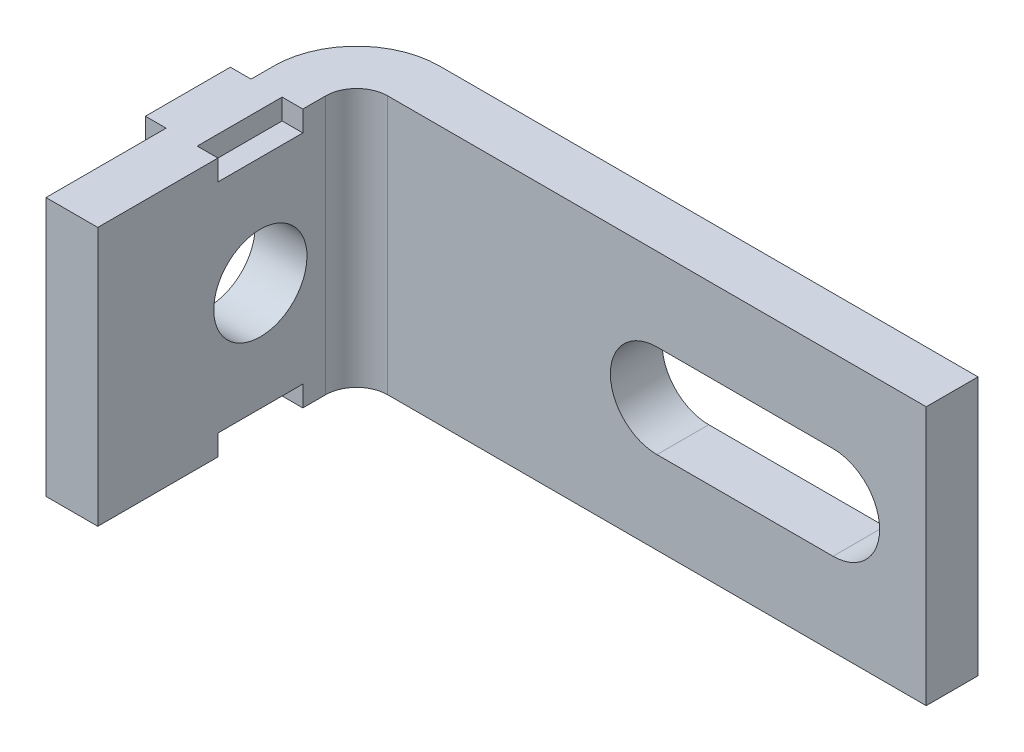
ISO-10303-21;
HEADER;
FILE_DESCRIPTION(('STEP AP214'),'2;1');
FILE_NAME('part.step','',(''),(''),'','','');
FILE_SCHEMA(('AUTOMOTIVE_DESIGN { 1 0 10303 214 1 1 1 1 }'));
ENDSEC;
DATA;
#1=APPLICATION_CONTEXT('core data for automotive mechanical design processes');
#2=APPLICATION_PROTOCOL_DEFINITION('international standard','automotive_design',2000,#1);
#3=PRODUCT_CONTEXT('',#1,'mechanical');
#4=PRODUCT('Part','Part','',(#3));
#5=PRODUCT_RELATED_PRODUCT_CATEGORY('part','',(#4));
#6=PRODUCT_DEFINITION_FORMATION('','',#4);
#7=PRODUCT_DEFINITION_CONTEXT('part definition',#1,'design');
#8=PRODUCT_DEFINITION('design','',#6,#7);
#9=PRODUCT_DEFINITION_SHAPE('','',#8);
#10=(LENGTH_UNIT() NAMED_UNIT(*) SI_UNIT(.MILLI.,.METRE.));
#11=(NAMED_UNIT(*) PLANE_ANGLE_UNIT() SI_UNIT($,.RADIAN.));
#12=(NAMED_UNIT(*) SI_UNIT($,.STERADIAN.) SOLID_ANGLE_UNIT());
#13=UNCERTAINTY_MEASURE_WITH_UNIT(LENGTH_MEASURE(1.E-05),#10,'distance_accuracy_value','');
#14=(GEOMETRIC_REPRESENTATION_CONTEXT(3) GLOBAL_UNCERTAINTY_ASSIGNED_CONTEXT((#13)) GLOBAL_UNIT_ASSIGNED_CONTEXT((#10,
#11,#12)) REPRESENTATION_CONTEXT('',''));
#15=CARTESIAN_POINT('',(0.,0.,0.));
#16=DIRECTION('',(0.,0.,1.));
#17=DIRECTION('',(1.,0.,0.));
#18=AXIS2_PLACEMENT_3D('',#15,#16,#17);
#19=CARTESIAN_POINT('',(-30.,10.5,18.4));
#20=DIRECTION('',(0.,-1.,0.));
#21=DIRECTION('',(0.,0.,-1.));
#22=AXIS2_PLACEMENT_3D('',#19,#20,#21);
#23=PLANE('',#22);
#24=DIRECTION('',(0.,0.,-1.));
#25=VECTOR('',#24,1.);
#26=CARTESIAN_POINT('',(-32.,10.5,18.4));
#27=LINE('',#26,#25);
#28=CARTESIAN_POINT('',(-32.,10.5,18.4));
#29=VERTEX_POINT('',#28);
#30=CARTESIAN_POINT('',(-32.,10.5,10.2));
#31=VERTEX_POINT('',#30);
#32=EDGE_CURVE('E9',#29,#31,#27,.T.);
#33=ORIENTED_EDGE('',*,*,#32,.T.);
#34=DIRECTION('',(-1.,0.,0.));
#35=VECTOR('',#34,1.);
#36=CARTESIAN_POINT('',(-30.,10.5,10.2));
#37=LINE('',#36,#35);
#38=CARTESIAN_POINT('',(-30.,10.5,10.2));
#39=VERTEX_POINT('',#38);
#40=EDGE_CURVE('E34',#39,#31,#37,.T.);
#41=ORIENTED_EDGE('',*,*,#40,.F.);
#42=DIRECTION('',(0.,0.,-1.));
#43=VECTOR('',#42,1.);
#44=CARTESIAN_POINT('',(-30.,10.5,24.2));
#45=LINE('',#44,#43);
#46=CARTESIAN_POINT('',(-30.,10.5,18.4));
#47=VERTEX_POINT('',#46);
#48=EDGE_CURVE('E231',#47,#39,#45,.T.);
#49=ORIENTED_EDGE('',*,*,#48,.F.);
#50=DIRECTION('',(-1.,0.,0.));
#51=VECTOR('',#50,1.);
#52=CARTESIAN_POINT('',(-30.,10.5,18.4));
#53=LINE('',#52,#51);
#54=EDGE_CURVE('E25',#47,#29,#53,.T.);
#55=ORIENTED_EDGE('',*,*,#54,.T.);
#56=EDGE_LOOP('',(#33,#41,#49,#55));
#57=FACE_BOUND('',#56,.T.);
#58=ADVANCED_FACE('F15',(#57),#23,.T.);
#59=CARTESIAN_POINT('',(-30.,10.5,10.2));
#60=DIRECTION('',(0.,0.,-1.));
#61=DIRECTION('',(-1.,0.,0.));
#62=AXIS2_PLACEMENT_3D('',#59,#60,#61);
#63=PLANE('',#62);
#64=DIRECTION('',(0.,1.,0.));
#65=VECTOR('',#64,1.);
#66=CARTESIAN_POINT('',(-32.,10.5,10.2));
#67=LINE('',#66,#65);
#68=CARTESIAN_POINT('',(-32.,12.5,10.2));
#69=VERTEX_POINT('',#68);
#70=EDGE_CURVE('E425',#31,#69,#67,.T.);
#71=ORIENTED_EDGE('',*,*,#70,.T.);
#72=DIRECTION('',(-1.,0.,0.));
#73=VECTOR('',#72,1.);
#74=CARTESIAN_POINT('',(-30.,12.5,10.2));
#75=LINE('',#74,#73);
#76=CARTESIAN_POINT('',(-30.,12.5,10.2));
#77=VERTEX_POINT('',#76);
#78=EDGE_CURVE('E243',#77,#69,#75,.T.);
#79=ORIENTED_EDGE('',*,*,#78,.F.);
#80=DIRECTION('',(0.,1.,0.));
#81=VECTOR('',#80,1.);
#82=CARTESIAN_POINT('',(-30.,5.25,10.2));
#83=LINE('',#82,#81);
#84=EDGE_CURVE('E335',#39,#77,#83,.T.);
#85=ORIENTED_EDGE('',*,*,#84,.F.);
#86=ORIENTED_EDGE('',*,*,#40,.T.);
#87=EDGE_LOOP('',(#71,#79,#85,#86));
#88=FACE_BOUND('',#87,.T.);
#89=ADVANCED_FACE('F440',(#88),#63,.T.);
#90=CARTESIAN_POINT('',(-30.,12.5,18.4));
#91=DIRECTION('',(0.,0.,1.));
#92=DIRECTION('',(1.,0.,0.));
#93=AXIS2_PLACEMENT_3D('',#90,#91,#92);
#94=PLANE('',#93);
#95=DIRECTION('',(0.,-1.,0.));
#96=VECTOR('',#95,1.);
#97=CARTESIAN_POINT('',(-32.,12.5,18.4));
#98=LINE('',#97,#96);
#99=CARTESIAN_POINT('',(-32.,12.5,18.4));
#100=VERTEX_POINT('',#99);
#101=EDGE_CURVE('E237',#100,#29,#98,.T.);
#102=ORIENTED_EDGE('',*,*,#101,.T.);
#103=ORIENTED_EDGE('',*,*,#54,.F.);
#104=DIRECTION('',(0.,-1.,0.));
#105=VECTOR('',#104,1.);
#106=CARTESIAN_POINT('',(-30.,6.25,18.4));
#107=LINE('',#106,#105);
#108=CARTESIAN_POINT('',(-30.,12.5,18.4));
#109=VERTEX_POINT('',#108);
#110=EDGE_CURVE('E230',#109,#47,#107,.T.);
#111=ORIENTED_EDGE('',*,*,#110,.F.);
#112=DIRECTION('',(-1.,0.,0.));
#113=VECTOR('',#112,1.);
#114=CARTESIAN_POINT('',(-30.,12.5,18.4));
#115=LINE('',#114,#113);
#116=EDGE_CURVE('E229',#109,#100,#115,.T.);
#117=ORIENTED_EDGE('',*,*,#116,.T.);
#118=EDGE_LOOP('',(#102,#103,#111,#117));
#119=FACE_BOUND('',#118,.T.);
#120=ADVANCED_FACE('F433',(#119),#94,.T.);
#121=CARTESIAN_POINT('',(-32.,11.5,14.3));
#122=DIRECTION('',(1.,0.,0.));
#123=DIRECTION('',(0.,0.,-1.));
#124=AXIS2_PLACEMENT_3D('',#121,#122,#123);
#125=PLANE('',#124);
#126=ORIENTED_EDGE('',*,*,#32,.F.);
#127=ORIENTED_EDGE('',*,*,#101,.F.);
#128=DIRECTION('',(0.,0.,1.));
#129=VECTOR('',#128,1.);
#130=CARTESIAN_POINT('',(-32.,12.5,10.2));
#131=LINE('',#130,#129);
#132=EDGE_CURVE('E241',#69,#100,#131,.T.);
#133=ORIENTED_EDGE('',*,*,#132,.F.);
#134=ORIENTED_EDGE('',*,*,#70,.F.);
#135=EDGE_LOOP('',(#126,#127,#133,#134));
#136=FACE_BOUND('',#135,.T.);
#137=ADVANCED_FACE('F437',(#136),#125,.F.);
#138=CARTESIAN_POINT('',(-30.,-12.5,10.2));
#139=DIRECTION('',(0.,0.,-1.));
#140=DIRECTION('',(-1.,0.,0.));
#141=AXIS2_PLACEMENT_3D('',#138,#139,#140);
#142=PLANE('',#141);
#143=DIRECTION('',(0.,1.,0.));
#144=VECTOR('',#143,1.);
#145=CARTESIAN_POINT('',(-32.,-12.5,10.2));
#146=LINE('',#145,#144);
#147=CARTESIAN_POINT('',(-32.,-12.5,10.2));
#148=VERTEX_POINT('',#147);
#149=CARTESIAN_POINT('',(-32.,-10.5,10.2));
#150=VERTEX_POINT('',#149);
#151=EDGE_CURVE('E240',#148,#150,#146,.T.);
#152=ORIENTED_EDGE('',*,*,#151,.T.);
#153=DIRECTION('',(-1.,0.,0.));
#154=VECTOR('',#153,1.);
#155=CARTESIAN_POINT('',(-30.,-10.5,10.2));
#156=LINE('',#155,#154);
#157=CARTESIAN_POINT('',(-30.,-10.5,10.2));
#158=VERTEX_POINT('',#157);
#159=EDGE_CURVE('E248',#158,#150,#156,.T.);
#160=ORIENTED_EDGE('',*,*,#159,.F.);
#161=DIRECTION('',(0.,1.,0.));
#162=VECTOR('',#161,1.);
#163=CARTESIAN_POINT('',(-30.,-6.25,10.2));
#164=LINE('',#163,#162);
#165=CARTESIAN_POINT('',(-30.,-12.5,10.2));
#166=VERTEX_POINT('',#165);
#167=EDGE_CURVE('E252',#166,#158,#164,.T.);
#168=ORIENTED_EDGE('',*,*,#167,.F.);
#169=DIRECTION('',(-1.,0.,0.));
#170=VECTOR('',#169,1.);
#171=CARTESIAN_POINT('',(-30.,-12.5,10.2));
#172=LINE('',#171,#170);
#173=EDGE_CURVE('E247',#166,#148,#172,.T.);
#174=ORIENTED_EDGE('',*,*,#173,.T.);
#175=EDGE_LOOP('',(#152,#160,#168,#174));
#176=FACE_BOUND('',#175,.T.);
#177=ADVANCED_FACE('F454',(#176),#142,.T.);
#178=CARTESIAN_POINT('',(-30.,-10.5,10.2));
#179=DIRECTION('',(0.,1.,0.));
#180=DIRECTION('',(0.,0.,1.));
#181=AXIS2_PLACEMENT_3D('',#178,#179,#180);
#182=PLANE('',#181);
#183=DIRECTION('',(0.,0.,1.));
#184=VECTOR('',#183,1.);
#185=CARTESIAN_POINT('',(-32.,-10.5,10.2));
#186=LINE('',#185,#184);
#187=CARTESIAN_POINT('',(-32.,-10.5,18.4));
#188=VERTEX_POINT('',#187);
#189=EDGE_CURVE('E250',#150,#188,#186,.T.);
#190=ORIENTED_EDGE('',*,*,#189,.T.);
#191=DIRECTION('',(-1.,0.,0.));
#192=VECTOR('',#191,1.);
#193=CARTESIAN_POINT('',(-30.,-10.5,18.4));
#194=LINE('',#193,#192);
#195=CARTESIAN_POINT('',(-30.,-10.5,18.4));
#196=VERTEX_POINT('',#195);
#197=EDGE_CURVE('E259',#196,#188,#194,.T.);
#198=ORIENTED_EDGE('',*,*,#197,.F.);
#199=DIRECTION('',(0.,0.,1.));
#200=VECTOR('',#199,1.);
#201=CARTESIAN_POINT('',(-30.,-10.5,20.1));
#202=LINE('',#201,#200);
#203=EDGE_CURVE('E255',#158,#196,#202,.T.);
#204=ORIENTED_EDGE('',*,*,#203,.F.);
#205=ORIENTED_EDGE('',*,*,#159,.T.);
#206=EDGE_LOOP('',(#190,#198,#204,#205));
#207=FACE_BOUND('',#206,.T.);
#208=ADVANCED_FACE('F457',(#207),#182,.T.);
#209=CARTESIAN_POINT('',(-30.,-10.5,18.4));
#210=DIRECTION('',(0.,0.,1.));
#211=DIRECTION('',(1.,0.,0.));
#212=AXIS2_PLACEMENT_3D('',#209,#210,#211);
#213=PLANE('',#212);
#214=DIRECTION('',(0.,-1.,0.));
#215=VECTOR('',#214,1.);
#216=CARTESIAN_POINT('',(-32.,-10.5,18.4));
#217=LINE('',#216,#215);
#218=CARTESIAN_POINT('',(-32.,-12.5,18.4));
#219=VERTEX_POINT('',#218);
#220=EDGE_CURVE('E251',#188,#219,#217,.T.);
#221=ORIENTED_EDGE('',*,*,#220,.T.);
#222=DIRECTION('',(-1.,0.,0.));
#223=VECTOR('',#222,1.);
#224=CARTESIAN_POINT('',(-30.,-12.5,18.4));
#225=LINE('',#224,#223);
#226=CARTESIAN_POINT('',(-30.,-12.5,18.4));
#227=VERTEX_POINT('',#226);
#228=EDGE_CURVE('E266',#227,#219,#225,.T.);
#229=ORIENTED_EDGE('',*,*,#228,.F.);
#230=DIRECTION('',(0.,-1.,0.));
#231=VECTOR('',#230,1.);
#232=CARTESIAN_POINT('',(-30.,-5.25,18.4));
#233=LINE('',#232,#231);
#234=EDGE_CURVE('E263',#196,#227,#233,.T.);
#235=ORIENTED_EDGE('',*,*,#234,.F.);
#236=ORIENTED_EDGE('',*,*,#197,.T.);
#237=EDGE_LOOP('',(#221,#229,#235,#236));
#238=FACE_BOUND('',#237,.T.);
#239=ADVANCED_FACE('F461',(#238),#213,.T.);
#240=CARTESIAN_POINT('',(-32.,-11.5,14.3));
#241=DIRECTION('',(1.,0.,0.));
#242=DIRECTION('',(0.,0.,-1.));
#243=AXIS2_PLACEMENT_3D('',#240,#241,#242);
#244=PLANE('',#243);
#245=DIRECTION('',(0.,0.,-1.));
#246=VECTOR('',#245,1.);
#247=CARTESIAN_POINT('',(-32.,-12.5,18.4));
#248=LINE('',#247,#246);
#249=EDGE_CURVE('E269',#219,#148,#248,.T.);
#250=ORIENTED_EDGE('',*,*,#249,.F.);
#251=ORIENTED_EDGE('',*,*,#220,.F.);
#252=ORIENTED_EDGE('',*,*,#189,.F.);
#253=ORIENTED_EDGE('',*,*,#151,.F.);
#254=EDGE_LOOP('',(#250,#251,#252,#253));
#255=FACE_BOUND('',#254,.T.);
#256=ADVANCED_FACE('F465',(#255),#244,.F.);
#257=CARTESIAN_POINT('',(-25.,12.5,18.4));
#258=DIRECTION('',(0.,0.,1.));
#259=DIRECTION('',(1.,0.,0.));
#260=AXIS2_PLACEMENT_3D('',#257,#258,#259);
#261=PLANE('',#260);
#262=DIRECTION('',(0.,-1.,0.));
#263=VECTOR('',#262,1.);
#264=CARTESIAN_POINT('',(-27.,10.5,18.4));
#265=LINE('',#264,#263);
#266=CARTESIAN_POINT('',(-27.,12.5,18.4));
#267=VERTEX_POINT('',#266);
#268=CARTESIAN_POINT('',(-27.,10.5,18.4));
#269=VERTEX_POINT('',#268);
#270=EDGE_CURVE('E274',#267,#269,#265,.T.);
#271=ORIENTED_EDGE('',*,*,#270,.F.);
#272=DIRECTION('',(-1.,0.,0.));
#273=VECTOR('',#272,1.);
#274=CARTESIAN_POINT('',(-16.0174599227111,12.5,18.4));
#275=LINE('',#274,#273);
#276=CARTESIAN_POINT('',(-25.,12.5,18.4));
#277=VERTEX_POINT('',#276);
#278=EDGE_CURVE('E244',#277,#267,#275,.T.);
#279=ORIENTED_EDGE('',*,*,#278,.F.);
#280=DIRECTION('',(0.,1.,0.));
#281=VECTOR('',#280,1.);
#282=CARTESIAN_POINT('',(-25.,6.25,18.4));
#283=LINE('',#282,#281);
#284=CARTESIAN_POINT('',(-25.,10.5,18.4));
#285=VERTEX_POINT('',#284);
#286=EDGE_CURVE('E280',#285,#277,#283,.T.);
#287=ORIENTED_EDGE('',*,*,#286,.F.);
#288=DIRECTION('',(-1.,0.,0.));
#289=VECTOR('',#288,1.);
#290=CARTESIAN_POINT('',(-25.,10.5,18.4));
#291=LINE('',#290,#289);
#292=EDGE_CURVE('E261',#285,#269,#291,.T.);
#293=ORIENTED_EDGE('',*,*,#292,.T.);
#294=EDGE_LOOP('',(#271,#279,#287,#293));
#295=FACE_BOUND('',#294,.T.);
#296=ADVANCED_FACE('F469',(#295),#261,.F.);
#297=CARTESIAN_POINT('',(-25.,10.5,18.4));
#298=DIRECTION('',(0.,-1.,0.));
#299=DIRECTION('',(0.,0.,-1.));
#300=AXIS2_PLACEMENT_3D('',#297,#298,#299);
#301=PLANE('',#300);
#302=DIRECTION('',(0.,0.,-1.));
#303=VECTOR('',#302,1.);
#304=CARTESIAN_POINT('',(-27.,10.5,10.2));
#305=LINE('',#304,#303);
#306=CARTESIAN_POINT('',(-27.,10.5,10.2));
#307=VERTEX_POINT('',#306);
#308=EDGE_CURVE('E277',#269,#307,#305,.T.);
#309=ORIENTED_EDGE('',*,*,#308,.F.);
#310=ORIENTED_EDGE('',*,*,#292,.F.);
#311=DIRECTION('',(0.,0.,1.));
#312=VECTOR('',#311,1.);
#313=CARTESIAN_POINT('',(-25.,10.5,13.2));
#314=LINE('',#313,#312);
#315=CARTESIAN_POINT('',(-25.,10.5,10.2));
#316=VERTEX_POINT('',#315);
#317=EDGE_CURVE('E283',#316,#285,#314,.T.);
#318=ORIENTED_EDGE('',*,*,#317,.F.);
#319=DIRECTION('',(-1.,0.,0.));
#320=VECTOR('',#319,1.);
#321=CARTESIAN_POINT('',(-25.,10.5,10.2));
#322=LINE('',#321,#320);
#323=EDGE_CURVE('E276',#316,#307,#322,.T.);
#324=ORIENTED_EDGE('',*,*,#323,.T.);
#325=EDGE_LOOP('',(#309,#310,#318,#324));
#326=FACE_BOUND('',#325,.T.);
#327=ADVANCED_FACE('F473',(#326),#301,.F.);
#328=CARTESIAN_POINT('',(-25.,10.5,10.2));
#329=DIRECTION('',(0.,0.,-1.));
#330=DIRECTION('',(-1.,0.,0.));
#331=AXIS2_PLACEMENT_3D('',#328,#329,#330);
#332=PLANE('',#331);
#333=DIRECTION('',(0.,1.,0.));
#334=VECTOR('',#333,1.);
#335=CARTESIAN_POINT('',(-27.,12.5,10.2));
#336=LINE('',#335,#334);
#337=CARTESIAN_POINT('',(-27.,12.5,10.2));
#338=VERTEX_POINT('',#337);
#339=EDGE_CURVE('E288',#307,#338,#336,.T.);
#340=ORIENTED_EDGE('',*,*,#339,.F.);
#341=ORIENTED_EDGE('',*,*,#323,.F.);
#342=DIRECTION('',(0.,-1.,0.));
#343=VECTOR('',#342,1.);
#344=CARTESIAN_POINT('',(-25.,5.25,10.2));
#345=LINE('',#344,#343);
#346=CARTESIAN_POINT('',(-25.,12.5,10.2));
#347=VERTEX_POINT('',#346);
#348=EDGE_CURVE('E291',#347,#316,#345,.T.);
#349=ORIENTED_EDGE('',*,*,#348,.F.);
#350=DIRECTION('',(1.,0.,0.));
#351=VECTOR('',#350,1.);
#352=CARTESIAN_POINT('',(-16.0174599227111,12.5,10.2));
#353=LINE('',#352,#351);
#354=EDGE_CURVE('E299',#338,#347,#353,.T.);
#355=ORIENTED_EDGE('',*,*,#354,.F.);
#356=EDGE_LOOP('',(#340,#341,#349,#355));
#357=FACE_BOUND('',#356,.T.);
#358=ADVANCED_FACE('F477',(#357),#332,.F.);
#359=CARTESIAN_POINT('',(-27.,11.5,14.3));
#360=DIRECTION('',(1.,0.,0.));
#361=DIRECTION('',(0.,0.,-1.));
#362=AXIS2_PLACEMENT_3D('',#359,#360,#361);
#363=PLANE('',#362);
#364=ORIENTED_EDGE('',*,*,#270,.T.);
#365=ORIENTED_EDGE('',*,*,#308,.T.);
#366=ORIENTED_EDGE('',*,*,#339,.T.);
#367=DIRECTION('',(0.,0.,-1.));
#368=VECTOR('',#367,1.);
#369=CARTESIAN_POINT('',(-27.,12.5,10.9305229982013));
#370=LINE('',#369,#368);
#371=EDGE_CURVE('E279',#267,#338,#370,.T.);
#372=ORIENTED_EDGE('',*,*,#371,.F.);
#373=EDGE_LOOP('',(#364,#365,#366,#372));
#374=FACE_BOUND('',#373,.T.);
#375=ADVANCED_FACE('F481',(#374),#363,.T.);
#376=CARTESIAN_POINT('',(-25.,-10.5,18.4));
#377=DIRECTION('',(0.,0.,1.));
#378=DIRECTION('',(1.,0.,0.));
#379=AXIS2_PLACEMENT_3D('',#376,#377,#378);
#380=PLANE('',#379);
#381=DIRECTION('',(0.,-1.,0.));
#382=VECTOR('',#381,1.);
#383=CARTESIAN_POINT('',(-27.,-12.5,18.4));
#384=LINE('',#383,#382);
#385=CARTESIAN_POINT('',(-27.,-10.5,18.4));
#386=VERTEX_POINT('',#385);
#387=CARTESIAN_POINT('',(-27.,-12.5,18.4));
#388=VERTEX_POINT('',#387);
#389=EDGE_CURVE('E303',#386,#388,#384,.T.);
#390=ORIENTED_EDGE('',*,*,#389,.F.);
#391=DIRECTION('',(-1.,0.,0.));
#392=VECTOR('',#391,1.);
#393=CARTESIAN_POINT('',(-25.,-10.5,18.4));
#394=LINE('',#393,#392);
#395=CARTESIAN_POINT('',(-25.,-10.5,18.4));
#396=VERTEX_POINT('',#395);
#397=EDGE_CURVE('E306',#396,#386,#394,.T.);
#398=ORIENTED_EDGE('',*,*,#397,.F.);
#399=DIRECTION('',(0.,1.,0.));
#400=VECTOR('',#399,1.);
#401=CARTESIAN_POINT('',(-25.,-5.25,18.4));
#402=LINE('',#401,#400);
#403=CARTESIAN_POINT('',(-25.,-12.5,18.4));
#404=VERTEX_POINT('',#403);
#405=EDGE_CURVE('E310',#404,#396,#402,.T.);
#406=ORIENTED_EDGE('',*,*,#405,.F.);
#407=DIRECTION('',(1.,0.,0.));
#408=VECTOR('',#407,1.);
#409=CARTESIAN_POINT('',(-16.0174599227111,-12.5,18.4));
#410=LINE('',#409,#408);
#411=EDGE_CURVE('E268',#388,#404,#410,.T.);
#412=ORIENTED_EDGE('',*,*,#411,.F.);
#413=EDGE_LOOP('',(#390,#398,#406,#412));
#414=FACE_BOUND('',#413,.T.);
#415=ADVANCED_FACE('F485',(#414),#380,.F.);
#416=CARTESIAN_POINT('',(-25.,-12.5,10.2));
#417=DIRECTION('',(0.,0.,-1.));
#418=DIRECTION('',(-1.,0.,0.));
#419=AXIS2_PLACEMENT_3D('',#416,#417,#418);
#420=PLANE('',#419);
#421=DIRECTION('',(0.,1.,0.));
#422=VECTOR('',#421,1.);
#423=CARTESIAN_POINT('',(-27.,-10.5,10.2));
#424=LINE('',#423,#422);
#425=CARTESIAN_POINT('',(-27.,-12.5,10.2));
#426=VERTEX_POINT('',#425);
#427=CARTESIAN_POINT('',(-27.,-10.5,10.2));
#428=VERTEX_POINT('',#427);
#429=EDGE_CURVE('E307',#426,#428,#424,.T.);
#430=ORIENTED_EDGE('',*,*,#429,.F.);
#431=DIRECTION('',(-1.,0.,0.));
#432=VECTOR('',#431,1.);
#433=CARTESIAN_POINT('',(-16.0174599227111,-12.5,10.2));
#434=LINE('',#433,#432);
#435=CARTESIAN_POINT('',(-25.,-12.5,10.2));
#436=VERTEX_POINT('',#435);
#437=EDGE_CURVE('E319',#436,#426,#434,.T.);
#438=ORIENTED_EDGE('',*,*,#437,.F.);
#439=DIRECTION('',(0.,-1.,0.));
#440=VECTOR('',#439,1.);
#441=CARTESIAN_POINT('',(-25.,-6.25,10.2));
#442=LINE('',#441,#440);
#443=CARTESIAN_POINT('',(-25.,-10.5,10.2));
#444=VERTEX_POINT('',#443);
#445=EDGE_CURVE('E321',#444,#436,#442,.T.);
#446=ORIENTED_EDGE('',*,*,#445,.F.);
#447=DIRECTION('',(-1.,0.,0.));
#448=VECTOR('',#447,1.);
#449=CARTESIAN_POINT('',(-25.,-10.5,10.2));
#450=LINE('',#449,#448);
#451=EDGE_CURVE('E296',#444,#428,#450,.T.);
#452=ORIENTED_EDGE('',*,*,#451,.T.);
#453=EDGE_LOOP('',(#430,#438,#446,#452));
#454=FACE_BOUND('',#453,.T.);
#455=ADVANCED_FACE('F489',(#454),#420,.F.);
#456=CARTESIAN_POINT('',(-25.,-10.5,10.2));
#457=DIRECTION('',(0.,1.,0.));
#458=DIRECTION('',(0.,0.,1.));
#459=AXIS2_PLACEMENT_3D('',#456,#457,#458);
#460=PLANE('',#459);
#461=DIRECTION('',(0.,0.,1.));
#462=VECTOR('',#461,1.);
#463=CARTESIAN_POINT('',(-27.,-10.5,18.4));
#464=LINE('',#463,#462);
#465=EDGE_CURVE('E318',#428,#386,#464,.T.);
#466=ORIENTED_EDGE('',*,*,#465,.F.);
#467=ORIENTED_EDGE('',*,*,#451,.F.);
#468=DIRECTION('',(0.,0.,-1.));
#469=VECTOR('',#468,1.);
#470=CARTESIAN_POINT('',(-25.,-10.5,9.10000000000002));
#471=LINE('',#470,#469);
#472=EDGE_CURVE('E313',#396,#444,#471,.T.);
#473=ORIENTED_EDGE('',*,*,#472,.F.);
#474=ORIENTED_EDGE('',*,*,#397,.T.);
#475=EDGE_LOOP('',(#466,#467,#473,#474));
#476=FACE_BOUND('',#475,.T.);
#477=ADVANCED_FACE('F493',(#476),#460,.F.);
#478=CARTESIAN_POINT('',(-27.,-11.5,14.3));
#479=DIRECTION('',(1.,0.,0.));
#480=DIRECTION('',(0.,0.,-1.));
#481=AXIS2_PLACEMENT_3D('',#478,#479,#480);
#482=PLANE('',#481);
#483=ORIENTED_EDGE('',*,*,#389,.T.);
#484=DIRECTION('',(0.,0.,1.));
#485=VECTOR('',#484,1.);
#486=CARTESIAN_POINT('',(-27.,-12.5,10.9305229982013));
#487=LINE('',#486,#485);
#488=EDGE_CURVE('E316',#426,#388,#487,.T.);
#489=ORIENTED_EDGE('',*,*,#488,.F.);
#490=ORIENTED_EDGE('',*,*,#429,.T.);
#491=ORIENTED_EDGE('',*,*,#465,.T.);
#492=EDGE_LOOP('',(#483,#489,#490,#491));
#493=FACE_BOUND('',#492,.T.);
#494=ADVANCED_FACE('F497',(#493),#482,.T.);
#495=CARTESIAN_POINT('',(-7.03491984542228,-12.5,7.5610459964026));
#496=DIRECTION('',(0.,1.,0.));
#497=DIRECTION('',(0.,0.,1.));
#498=AXIS2_PLACEMENT_3D('',#495,#496,#497);
#499=PLANE('',#498);
#500=ORIENTED_EDGE('',*,*,#437,.T.);
#501=ORIENTED_EDGE('',*,*,#488,.T.);
#502=ORIENTED_EDGE('',*,*,#411,.T.);
#503=DIRECTION('',(0.,0.,-1.));
#504=VECTOR('',#503,1.);
#505=CARTESIAN_POINT('',(-25.,-12.5,8.00000000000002));
#506=LINE('',#505,#504);
#507=CARTESIAN_POINT('',(-25.,-12.5,30.));
#508=VERTEX_POINT('',#507);
#509=EDGE_CURVE('E312',#508,#404,#506,.T.);
#510=ORIENTED_EDGE('',*,*,#509,.F.);
#511=DIRECTION('',(1.,0.,0.));
#512=VECTOR('',#511,1.);
#513=CARTESIAN_POINT('',(-25.,-12.5,30.));
#514=LINE('',#513,#512);
#515=CARTESIAN_POINT('',(-30.,-12.5,30.));
#516=VERTEX_POINT('',#515);
#517=EDGE_CURVE('E224',#516,#508,#514,.T.);
#518=ORIENTED_EDGE('',*,*,#517,.F.);
#519=DIRECTION('',(0.,0.,1.));
#520=VECTOR('',#519,1.);
#521=CARTESIAN_POINT('',(-30.,-12.5,30.));
#522=LINE('',#521,#520);
#523=EDGE_CURVE('E211',#227,#516,#522,.T.);
#524=ORIENTED_EDGE('',*,*,#523,.F.);
#525=ORIENTED_EDGE('',*,*,#228,.T.);
#526=ORIENTED_EDGE('',*,*,#249,.T.);
#527=ORIENTED_EDGE('',*,*,#173,.F.);
#528=DIRECTION('',(0.,0.,1.));
#529=VECTOR('',#528,1.);
#530=CARTESIAN_POINT('',(-30.,-12.5,30.));
#531=LINE('',#530,#529);
#532=CARTESIAN_POINT('',(-30.,-12.5,8.00000000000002));
#533=VERTEX_POINT('',#532);
#534=EDGE_CURVE('E254',#533,#166,#531,.T.);
#535=ORIENTED_EDGE('',*,*,#534,.F.);
#536=CARTESIAN_POINT('',(-22.,-12.5,8.00000000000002));
#537=DIRECTION('',(0.,1.,0.));
#538=DIRECTION('',(1.,0.,0.));
#539=AXIS2_PLACEMENT_3D('',#536,#537,#538);
#540=CIRCLE('',#539,8.);
#541=CARTESIAN_POINT('',(-22.,-12.5,0.));
#542=VERTEX_POINT('',#541);
#543=EDGE_CURVE('E340',#542,#533,#540,.T.);
#544=ORIENTED_EDGE('',*,*,#543,.F.);
#545=DIRECTION('',(-1.,0.,0.));
#546=VECTOR('',#545,1.);
#547=CARTESIAN_POINT('',(-22.,-12.5,0.));
#548=LINE('',#547,#546);
#549=CARTESIAN_POINT('',(30.,-12.5,0.));
#550=VERTEX_POINT('',#549);
#551=EDGE_CURVE('E345',#550,#542,#548,.T.);
#552=ORIENTED_EDGE('',*,*,#551,.F.);
#553=DIRECTION('',(0.,0.,-1.));
#554=VECTOR('',#553,1.);
#555=CARTESIAN_POINT('',(30.,-12.5,0.));
#556=LINE('',#555,#554);
#557=CARTESIAN_POINT('',(30.,-12.5,4.99999999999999));
#558=VERTEX_POINT('',#557);
#559=EDGE_CURVE('E349',#558,#550,#556,.T.);
#560=ORIENTED_EDGE('',*,*,#559,.F.);
#561=DIRECTION('',(1.,0.,0.));
#562=VECTOR('',#561,1.);
#563=CARTESIAN_POINT('',(30.,-12.5,4.99999999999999));
#564=LINE('',#563,#562);
#565=CARTESIAN_POINT('',(-22.,-12.5,5.00000000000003));
#566=VERTEX_POINT('',#565);
#567=EDGE_CURVE('E353',#566,#558,#564,.T.);
#568=ORIENTED_EDGE('',*,*,#567,.F.);
#569=CARTESIAN_POINT('',(-22.,-12.5,8.00000000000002));
#570=DIRECTION('',(0.,-1.,0.));
#571=DIRECTION('',(0.,0.,-1.));
#572=AXIS2_PLACEMENT_3D('',#569,#570,#571);
#573=CIRCLE('',#572,3.);
#574=CARTESIAN_POINT('',(-25.,-12.5,8.00000000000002));
#575=VERTEX_POINT('',#574);
#576=EDGE_CURVE('E223',#575,#566,#573,.T.);
#577=ORIENTED_EDGE('',*,*,#576,.F.);
#578=DIRECTION('',(0.,0.,-1.));
#579=VECTOR('',#578,1.);
#580=CARTESIAN_POINT('',(-25.,-12.5,8.00000000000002));
#581=LINE('',#580,#579);
#582=EDGE_CURVE('E323',#436,#575,#581,.T.);
#583=ORIENTED_EDGE('',*,*,#582,.F.);
#584=EDGE_LOOP('',(#500,#501,#502,#510,#518,#524,#525,#526,#527,#535,#544,#552,#560,#568,#577,#583));
#585=FACE_BOUND('',#584,.T.);
#586=ADVANCED_FACE('F501',(#585),#499,.F.);
#587=CARTESIAN_POINT('',(-25.,0.,8.00000000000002));
#588=DIRECTION('',(1.,0.,0.));
#589=DIRECTION('',(0.,0.,-1.));
#590=AXIS2_PLACEMENT_3D('',#587,#588,#589);
#591=PLANE('',#590);
#592=CARTESIAN_POINT('',(-25.,0.,14.3));
#593=DIRECTION('',(-1.,0.,0.));
#594=DIRECTION('',(0.,1.,0.));
#595=AXIS2_PLACEMENT_3D('',#592,#593,#594);
#596=CIRCLE('',#595,4.5);
#597=CARTESIAN_POINT('',(-25.,4.5,14.3));
#598=VERTEX_POINT('',#597);
#599=EDGE_CURVE('E273',#598,#598,#596,.T.);
#600=ORIENTED_EDGE('',*,*,#599,.T.);
#601=EDGE_LOOP('',(#600));
#602=FACE_BOUND('',#601,.T.);
#603=ORIENTED_EDGE('',*,*,#348,.T.);
#604=ORIENTED_EDGE('',*,*,#317,.T.);
#605=ORIENTED_EDGE('',*,*,#286,.T.);
#606=DIRECTION('',(0.,0.,1.));
#607=VECTOR('',#606,1.);
#608=CARTESIAN_POINT('',(-25.,12.5,8.00000000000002));
#609=LINE('',#608,#607);
#610=CARTESIAN_POINT('',(-25.,12.5,30.));
#611=VERTEX_POINT('',#610);
#612=EDGE_CURVE('E284',#277,#611,#609,.T.);
#613=ORIENTED_EDGE('',*,*,#612,.T.);
#614=DIRECTION('',(0.,-1.,0.));
#615=VECTOR('',#614,1.);
#616=CARTESIAN_POINT('',(-25.,0.,30.));
#617=LINE('',#616,#615);
#618=EDGE_CURVE('E219',#611,#508,#617,.T.);
#619=ORIENTED_EDGE('',*,*,#618,.T.);
#620=ORIENTED_EDGE('',*,*,#509,.T.);
#621=ORIENTED_EDGE('',*,*,#405,.T.);
#622=ORIENTED_EDGE('',*,*,#472,.T.);
#623=ORIENTED_EDGE('',*,*,#445,.T.);
#624=ORIENTED_EDGE('',*,*,#582,.T.);
#625=DIRECTION('',(0.,-1.,0.));
#626=VECTOR('',#625,1.);
#627=CARTESIAN_POINT('',(-25.,0.,8.00000000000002));
#628=LINE('',#627,#626);
#629=CARTESIAN_POINT('',(-25.,12.5,8.00000000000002));
#630=VERTEX_POINT('',#629);
#631=EDGE_CURVE('E357',#630,#575,#628,.T.);
#632=ORIENTED_EDGE('',*,*,#631,.F.);
#633=DIRECTION('',(0.,0.,1.));
#634=VECTOR('',#633,1.);
#635=CARTESIAN_POINT('',(-25.,12.5,8.00000000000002));
#636=LINE('',#635,#634);
#637=EDGE_CURVE('E360',#630,#347,#636,.T.);
#638=ORIENTED_EDGE('',*,*,#637,.T.);
#639=EDGE_LOOP('',(#603,#604,#605,#613,#619,#620,#621,#622,#623,#624,#632,#638));
#640=FACE_BOUND('',#639,.T.);
#641=ADVANCED_FACE('F505',(#602,#640),#591,.T.);
#642=CARTESIAN_POINT('',(21.,4.5,5.));
#643=DIRECTION('',(0.,1.,0.));
#644=DIRECTION('',(0.,0.,1.));
#645=AXIS2_PLACEMENT_3D('',#642,#643,#644);
#646=PLANE('',#645);
#647=DIRECTION('',(-1.,0.,0.));
#648=VECTOR('',#647,1.);
#649=CARTESIAN_POINT('',(-0.500000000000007,4.5,0.));
#650=LINE('',#649,#648);
#651=CARTESIAN_POINT('',(21.,4.5,0.));
#652=VERTEX_POINT('',#651);
#653=CARTESIAN_POINT('',(3.99999999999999,4.5,0.));
#654=VERTEX_POINT('',#653);
#655=EDGE_CURVE('E370',#652,#654,#650,.T.);
#656=ORIENTED_EDGE('',*,*,#655,.F.);
#657=DIRECTION('',(0.,0.,-1.));
#658=VECTOR('',#657,1.);
#659=CARTESIAN_POINT('',(21.,4.5,5.));
#660=LINE('',#659,#658);
#661=CARTESIAN_POINT('',(21.,4.5,5.));
#662=VERTEX_POINT('',#661);
#663=EDGE_CURVE('E374',#662,#652,#660,.T.);
#664=ORIENTED_EDGE('',*,*,#663,.F.);
#665=DIRECTION('',(1.,0.,0.));
#666=VECTOR('',#665,1.);
#667=CARTESIAN_POINT('',(25.5,4.5,4.99999999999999));
#668=LINE('',#667,#666);
#669=CARTESIAN_POINT('',(3.99999999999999,4.5,5.00000000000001));
#670=VERTEX_POINT('',#669);
#671=EDGE_CURVE('E379',#670,#662,#668,.T.);
#672=ORIENTED_EDGE('',*,*,#671,.F.);
#673=DIRECTION('',(0.,0.,-1.));
#674=VECTOR('',#673,1.);
#675=CARTESIAN_POINT('',(3.99999999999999,4.5,5.00000000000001));
#676=LINE('',#675,#674);
#677=EDGE_CURVE('E369',#670,#654,#676,.T.);
#678=ORIENTED_EDGE('',*,*,#677,.T.);
#679=EDGE_LOOP('',(#656,#664,#672,#678));
#680=FACE_BOUND('',#679,.T.);
#681=ADVANCED_FACE('F509',(#680),#646,.F.);
#682=CARTESIAN_POINT('',(3.99999999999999,0.,5.00000000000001));
#683=DIRECTION('',(0.,0.,-1.));
#684=DIRECTION('',(-1.,0.,0.));
#685=AXIS2_PLACEMENT_3D('',#682,#683,#684);
#686=CYLINDRICAL_SURFACE('',#685,4.5);
#687=CARTESIAN_POINT('',(3.99999999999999,0.,0.));
#688=DIRECTION('',(0.,0.,1.));
#689=DIRECTION('',(1.,0.,0.));
#690=AXIS2_PLACEMENT_3D('',#687,#688,#689);
#691=CIRCLE('',#690,4.5);
#692=CARTESIAN_POINT('',(3.99999999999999,-4.5,0.));
#693=VERTEX_POINT('',#692);
#694=EDGE_CURVE('E373',#654,#693,#691,.T.);
#695=ORIENTED_EDGE('',*,*,#694,.F.);
#696=ORIENTED_EDGE('',*,*,#677,.F.);
#697=CARTESIAN_POINT('',(3.99999999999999,0.,5.00000000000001));
#698=DIRECTION('',(0.,0.,-1.));
#699=DIRECTION('',(-1.,0.,0.));
#700=AXIS2_PLACEMENT_3D('',#697,#698,#699);
#701=CIRCLE('',#700,4.5);
#702=CARTESIAN_POINT('',(3.99999999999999,-4.5,5.00000000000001));
#703=VERTEX_POINT('',#702);
#704=EDGE_CURVE('E381',#703,#670,#701,.T.);
#705=ORIENTED_EDGE('',*,*,#704,.F.);
#706=DIRECTION('',(0.,0.,-1.));
#707=VECTOR('',#706,1.);
#708=CARTESIAN_POINT('',(3.99999999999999,-4.5,5.00000000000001));
#709=LINE('',#708,#707);
#710=EDGE_CURVE('E385',#703,#693,#709,.T.);
#711=ORIENTED_EDGE('',*,*,#710,.T.);
#712=EDGE_LOOP('',(#695,#696,#705,#711));
#713=FACE_BOUND('',#712,.T.);
#714=ADVANCED_FACE('F513',(#713),#686,.F.);
#715=CARTESIAN_POINT('',(3.99999999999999,-4.5,5.00000000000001));
#716=DIRECTION('',(0.,-1.,0.));
#717=DIRECTION('',(0.,0.,-1.));
#718=AXIS2_PLACEMENT_3D('',#715,#716,#717);
#719=PLANE('',#718);
#720=DIRECTION('',(1.,0.,0.));
#721=VECTOR('',#720,1.);
#722=CARTESIAN_POINT('',(-9.00000000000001,-4.5,0.));
#723=LINE('',#722,#721);
#724=CARTESIAN_POINT('',(21.,-4.5,0.));
#725=VERTEX_POINT('',#724);
#726=EDGE_CURVE('E344',#693,#725,#723,.T.);
#727=ORIENTED_EDGE('',*,*,#726,.F.);
#728=ORIENTED_EDGE('',*,*,#710,.F.);
#729=DIRECTION('',(-1.,0.,0.));
#730=VECTOR('',#729,1.);
#731=CARTESIAN_POINT('',(17.,-4.5,5.));
#732=LINE('',#731,#730);
#733=CARTESIAN_POINT('',(21.,-4.5,5.));
#734=VERTEX_POINT('',#733);
#735=EDGE_CURVE('E352',#734,#703,#732,.T.);
#736=ORIENTED_EDGE('',*,*,#735,.F.);
#737=DIRECTION('',(0.,0.,-1.));
#738=VECTOR('',#737,1.);
#739=CARTESIAN_POINT('',(21.,-4.5,5.));
#740=LINE('',#739,#738);
#741=EDGE_CURVE('E377',#734,#725,#740,.T.);
#742=ORIENTED_EDGE('',*,*,#741,.T.);
#743=EDGE_LOOP('',(#727,#728,#736,#742));
#744=FACE_BOUND('',#743,.T.);
#745=ADVANCED_FACE('F515',(#744),#719,.F.);
#746=CARTESIAN_POINT('',(21.,0.,5.));
#747=DIRECTION('',(0.,0.,-1.));
#748=DIRECTION('',(-1.,0.,0.));
#749=AXIS2_PLACEMENT_3D('',#746,#747,#748);
#750=CYLINDRICAL_SURFACE('',#749,4.5);
#751=CARTESIAN_POINT('',(21.,0.,0.));
#752=DIRECTION('',(0.,0.,1.));
#753=DIRECTION('',(1.,0.,0.));
#754=AXIS2_PLACEMENT_3D('',#751,#752,#753);
#755=CIRCLE('',#754,4.5);
#756=EDGE_CURVE('E372',#725,#652,#755,.T.);
#757=ORIENTED_EDGE('',*,*,#756,.F.);
#758=ORIENTED_EDGE('',*,*,#741,.F.);
#759=CARTESIAN_POINT('',(21.,0.,5.));
#760=DIRECTION('',(0.,0.,-1.));
#761=DIRECTION('',(-1.,0.,0.));
#762=AXIS2_PLACEMENT_3D('',#759,#760,#761);
#763=CIRCLE('',#762,4.5);
#764=EDGE_CURVE('E382',#662,#734,#763,.T.);
#765=ORIENTED_EDGE('',*,*,#764,.F.);
#766=ORIENTED_EDGE('',*,*,#663,.T.);
#767=EDGE_LOOP('',(#757,#758,#765,#766));
#768=FACE_BOUND('',#767,.T.);
#769=ADVANCED_FACE('F518',(#768),#750,.F.);
#770=CARTESIAN_POINT('',(-25.,0.,14.3));
#771=DIRECTION('',(-1.,0.,0.));
#772=DIRECTION('',(0.,1.,0.));
#773=AXIS2_PLACEMENT_3D('',#770,#771,#772);
#774=CYLINDRICAL_SURFACE('',#773,4.5);
#775=CARTESIAN_POINT('',(-30.,0.,14.3));
#776=DIRECTION('',(1.,0.,0.));
#777=DIRECTION('',(0.,1.,0.));
#778=AXIS2_PLACEMENT_3D('',#775,#776,#777);
#779=CIRCLE('',#778,4.5);
#780=CARTESIAN_POINT('',(-30.,4.5,14.3));
#781=VERTEX_POINT('',#780);
#782=EDGE_CURVE('E233',#781,#781,#779,.T.);
#783=ORIENTED_EDGE('',*,*,#782,.F.);
#784=EDGE_LOOP('',(#783));
#785=FACE_BOUND('',#784,.T.);
#786=ORIENTED_EDGE('',*,*,#599,.F.);
#787=EDGE_LOOP('',(#786));
#788=FACE_BOUND('',#787,.T.);
#789=ADVANCED_FACE('F541',(#785,#788),#774,.F.);
#790=CARTESIAN_POINT('',(-22.,0.,8.00000000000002));
#791=DIRECTION('',(0.,1.,0.));
#792=DIRECTION('',(1.,0.,0.));
#793=AXIS2_PLACEMENT_3D('',#790,#791,#792);
#794=CYLINDRICAL_SURFACE('',#793,8.);
#795=CARTESIAN_POINT('',(-22.,12.5,8.00000000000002));
#796=DIRECTION('',(0.,-1.,0.));
#797=DIRECTION('',(0.,0.,-1.));
#798=AXIS2_PLACEMENT_3D('',#795,#796,#797);
#799=CIRCLE('',#798,8.);
#800=CARTESIAN_POINT('',(-30.,12.5,8.00000000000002));
#801=VERTEX_POINT('',#800);
#802=CARTESIAN_POINT('',(-22.,12.5,0.));
#803=VERTEX_POINT('',#802);
#804=EDGE_CURVE('E378',#801,#803,#799,.T.);
#805=ORIENTED_EDGE('',*,*,#804,.T.);
#806=DIRECTION('',(0.,-1.,0.));
#807=VECTOR('',#806,1.);
#808=CARTESIAN_POINT('',(-22.,0.,0.));
#809=LINE('',#808,#807);
#810=EDGE_CURVE('E343',#803,#542,#809,.T.);
#811=ORIENTED_EDGE('',*,*,#810,.T.);
#812=ORIENTED_EDGE('',*,*,#543,.T.);
#813=DIRECTION('',(0.,-1.,0.));
#814=VECTOR('',#813,1.);
#815=CARTESIAN_POINT('',(-30.,0.,8.00000000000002));
#816=LINE('',#815,#814);
#817=EDGE_CURVE('E339',#801,#533,#816,.T.);
#818=ORIENTED_EDGE('',*,*,#817,.F.);
#819=EDGE_LOOP('',(#805,#811,#812,#818));
#820=FACE_BOUND('',#819,.T.);
#821=ADVANCED_FACE('F524',(#820),#794,.T.);
#822=CARTESIAN_POINT('',(-22.,0.,0.));
#823=DIRECTION('',(0.,0.,-1.));
#824=DIRECTION('',(-1.,0.,0.));
#825=AXIS2_PLACEMENT_3D('',#822,#823,#824);
#826=PLANE('',#825);
#827=ORIENTED_EDGE('',*,*,#726,.T.);
#828=ORIENTED_EDGE('',*,*,#756,.T.);
#829=ORIENTED_EDGE('',*,*,#655,.T.);
#830=ORIENTED_EDGE('',*,*,#694,.T.);
#831=EDGE_LOOP('',(#827,#828,#829,#830));
#832=FACE_BOUND('',#831,.T.);
#833=DIRECTION('',(1.,0.,0.));
#834=VECTOR('',#833,1.);
#835=CARTESIAN_POINT('',(-22.,12.5,0.));
#836=LINE('',#835,#834);
#837=CARTESIAN_POINT('',(30.,12.5,0.));
#838=VERTEX_POINT('',#837);
#839=EDGE_CURVE('E387',#803,#838,#836,.T.);
#840=ORIENTED_EDGE('',*,*,#839,.T.);
#841=DIRECTION('',(0.,-1.,0.));
#842=VECTOR('',#841,1.);
#843=CARTESIAN_POINT('',(30.,0.,0.));
#844=LINE('',#843,#842);
#845=EDGE_CURVE('E347',#838,#550,#844,.T.);
#846=ORIENTED_EDGE('',*,*,#845,.T.);
#847=ORIENTED_EDGE('',*,*,#551,.T.);
#848=ORIENTED_EDGE('',*,*,#810,.F.);
#849=EDGE_LOOP('',(#840,#846,#847,#848));
#850=FACE_BOUND('',#849,.T.);
#851=ADVANCED_FACE('F520',(#832,#850),#826,.T.);
#852=CARTESIAN_POINT('',(30.,0.,0.));
#853=DIRECTION('',(1.,0.,0.));
#854=DIRECTION('',(0.,0.,-1.));
#855=AXIS2_PLACEMENT_3D('',#852,#853,#854);
#856=PLANE('',#855);
#857=DIRECTION('',(0.,0.,1.));
#858=VECTOR('',#857,1.);
#859=CARTESIAN_POINT('',(30.,12.5,0.));
#860=LINE('',#859,#858);
#861=CARTESIAN_POINT('',(30.,12.5,4.99999999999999));
#862=VERTEX_POINT('',#861);
#863=EDGE_CURVE('E348',#838,#862,#860,.T.);
#864=ORIENTED_EDGE('',*,*,#863,.T.);
#865=DIRECTION('',(0.,-1.,0.));
#866=VECTOR('',#865,1.);
#867=CARTESIAN_POINT('',(30.,0.,4.99999999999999));
#868=LINE('',#867,#866);
#869=EDGE_CURVE('E351',#862,#558,#868,.T.);
#870=ORIENTED_EDGE('',*,*,#869,.T.);
#871=ORIENTED_EDGE('',*,*,#559,.T.);
#872=ORIENTED_EDGE('',*,*,#845,.F.);
#873=EDGE_LOOP('',(#864,#870,#871,#872));
#874=FACE_BOUND('',#873,.T.);
#875=ADVANCED_FACE('F523',(#874),#856,.T.);
#876=CARTESIAN_POINT('',(30.,0.,4.99999999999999));
#877=DIRECTION('',(0.,0.,1.));
#878=DIRECTION('',(1.,0.,0.));
#879=AXIS2_PLACEMENT_3D('',#876,#877,#878);
#880=PLANE('',#879);
#881=ORIENTED_EDGE('',*,*,#735,.T.);
#882=ORIENTED_EDGE('',*,*,#704,.T.);
#883=ORIENTED_EDGE('',*,*,#671,.T.);
#884=ORIENTED_EDGE('',*,*,#764,.T.);
#885=EDGE_LOOP('',(#881,#882,#883,#884));
#886=FACE_BOUND('',#885,.T.);
#887=DIRECTION('',(-1.,0.,0.));
#888=VECTOR('',#887,1.);
#889=CARTESIAN_POINT('',(30.,12.5,4.99999999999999));
#890=LINE('',#889,#888);
#891=CARTESIAN_POINT('',(-22.,12.5,5.00000000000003));
#892=VERTEX_POINT('',#891);
#893=EDGE_CURVE('E401',#862,#892,#890,.T.);
#894=ORIENTED_EDGE('',*,*,#893,.T.);
#895=DIRECTION('',(0.,-1.,0.));
#896=VECTOR('',#895,1.);
#897=CARTESIAN_POINT('',(-22.,0.,5.00000000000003));
#898=LINE('',#897,#896);
#899=EDGE_CURVE('E197',#892,#566,#898,.T.);
#900=ORIENTED_EDGE('',*,*,#899,.T.);
#901=ORIENTED_EDGE('',*,*,#567,.T.);
#902=ORIENTED_EDGE('',*,*,#869,.F.);
#903=EDGE_LOOP('',(#894,#900,#901,#902));
#904=FACE_BOUND('',#903,.T.);
#905=ADVANCED_FACE('F528',(#886,#904),#880,.T.);
#906=CARTESIAN_POINT('',(-22.,0.,8.00000000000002));
#907=DIRECTION('',(0.,1.,0.));
#908=DIRECTION('',(1.,0.,0.));
#909=AXIS2_PLACEMENT_3D('',#906,#907,#908);
#910=CYLINDRICAL_SURFACE('',#909,3.);
#911=CARTESIAN_POINT('',(-22.,12.5,8.00000000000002));
#912=DIRECTION('',(0.,1.,0.));
#913=DIRECTION('',(1.,0.,0.));
#914=AXIS2_PLACEMENT_3D('',#911,#912,#913);
#915=CIRCLE('',#914,3.);
#916=EDGE_CURVE('E355',#892,#630,#915,.T.);
#917=ORIENTED_EDGE('',*,*,#916,.T.);
#918=ORIENTED_EDGE('',*,*,#631,.T.);
#919=ORIENTED_EDGE('',*,*,#576,.T.);
#920=ORIENTED_EDGE('',*,*,#899,.F.);
#921=EDGE_LOOP('',(#917,#918,#919,#920));
#922=FACE_BOUND('',#921,.T.);
#923=ADVANCED_FACE('F17',(#922),#910,.F.);
#924=CARTESIAN_POINT('',(-25.,0.,30.));
#925=DIRECTION('',(0.,0.,1.));
#926=DIRECTION('',(1.,0.,0.));
#927=AXIS2_PLACEMENT_3D('',#924,#925,#926);
#928=PLANE('',#927);
#929=DIRECTION('',(-1.,0.,0.));
#930=VECTOR('',#929,1.);
#931=CARTESIAN_POINT('',(-25.,12.5,30.));
#932=LINE('',#931,#930);
#933=CARTESIAN_POINT('',(-30.,12.5,30.));
#934=VERTEX_POINT('',#933);
#935=EDGE_CURVE('E216',#611,#934,#932,.T.);
#936=ORIENTED_EDGE('',*,*,#935,.T.);
#937=DIRECTION('',(0.,1.,0.));
#938=VECTOR('',#937,1.);
#939=CARTESIAN_POINT('',(-30.,0.,30.));
#940=LINE('',#939,#938);
#941=EDGE_CURVE('E203',#516,#934,#940,.T.);
#942=ORIENTED_EDGE('',*,*,#941,.F.);
#943=ORIENTED_EDGE('',*,*,#517,.T.);
#944=ORIENTED_EDGE('',*,*,#618,.F.);
#945=EDGE_LOOP('',(#936,#942,#943,#944));
#946=FACE_BOUND('',#945,.T.);
#947=ADVANCED_FACE('F217',(#946),#928,.T.);
#948=CARTESIAN_POINT('',(-30.,0.,30.));
#949=DIRECTION('',(-1.,0.,0.));
#950=DIRECTION('',(0.,0.,1.));
#951=AXIS2_PLACEMENT_3D('',#948,#949,#950);
#952=PLANE('',#951);
#953=ORIENTED_EDGE('',*,*,#84,.T.);
#954=DIRECTION('',(0.,0.,-1.));
#955=VECTOR('',#954,1.);
#956=CARTESIAN_POINT('',(-30.,12.5,30.));
#957=LINE('',#956,#955);
#958=EDGE_CURVE('E410',#77,#801,#957,.T.);
#959=ORIENTED_EDGE('',*,*,#958,.T.);
#960=ORIENTED_EDGE('',*,*,#817,.T.);
#961=ORIENTED_EDGE('',*,*,#534,.T.);
#962=ORIENTED_EDGE('',*,*,#167,.T.);
#963=ORIENTED_EDGE('',*,*,#203,.T.);
#964=ORIENTED_EDGE('',*,*,#234,.T.);
#965=ORIENTED_EDGE('',*,*,#523,.T.);
#966=ORIENTED_EDGE('',*,*,#941,.T.);
#967=DIRECTION('',(0.,0.,-1.));
#968=VECTOR('',#967,1.);
#969=CARTESIAN_POINT('',(-30.,12.5,30.));
#970=LINE('',#969,#968);
#971=EDGE_CURVE('E19',#934,#109,#970,.T.);
#972=ORIENTED_EDGE('',*,*,#971,.T.);
#973=ORIENTED_EDGE('',*,*,#110,.T.);
#974=ORIENTED_EDGE('',*,*,#48,.T.);
#975=EDGE_LOOP('',(#953,#959,#960,#961,#962,#963,#964,#965,#966,#972,#973,#974));
#976=FACE_BOUND('',#975,.T.);
#977=ORIENTED_EDGE('',*,*,#782,.T.);
#978=EDGE_LOOP('',(#977));
#979=FACE_BOUND('',#978,.T.);
#980=ADVANCED_FACE('F206',(#976,#979),#952,.T.);
#981=CARTESIAN_POINT('',(-7.03491984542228,12.5,7.5610459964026));
#982=DIRECTION('',(0.,1.,0.));
#983=DIRECTION('',(0.,0.,1.));
#984=AXIS2_PLACEMENT_3D('',#981,#982,#983);
#985=PLANE('',#984);
#986=ORIENTED_EDGE('',*,*,#354,.T.);
#987=ORIENTED_EDGE('',*,*,#637,.F.);
#988=ORIENTED_EDGE('',*,*,#916,.F.);
#989=ORIENTED_EDGE('',*,*,#893,.F.);
#990=ORIENTED_EDGE('',*,*,#863,.F.);
#991=ORIENTED_EDGE('',*,*,#839,.F.);
#992=ORIENTED_EDGE('',*,*,#804,.F.);
#993=ORIENTED_EDGE('',*,*,#958,.F.);
#994=ORIENTED_EDGE('',*,*,#78,.T.);
#995=ORIENTED_EDGE('',*,*,#132,.T.);
#996=ORIENTED_EDGE('',*,*,#116,.F.);
#997=ORIENTED_EDGE('',*,*,#971,.F.);
#998=ORIENTED_EDGE('',*,*,#935,.F.);
#999=ORIENTED_EDGE('',*,*,#612,.F.);
#1000=ORIENTED_EDGE('',*,*,#278,.T.);
#1001=ORIENTED_EDGE('',*,*,#371,.T.);
#1002=EDGE_LOOP('',(#986,#987,#988,#989,#990,#991,#992,#993,#994,#995,#996,#997,#998,#999,#1000,#1001));
#1003=FACE_BOUND('',#1002,.T.);
#1004=ADVANCED_FACE('F227',(#1003),#985,.T.);
#1005=CLOSED_SHELL('',(#58,#89,#120,#137,#177,#208,#239,#256,#296,#327,#358,#375,#415,#455,#477,
#494,#586,#641,#681,#714,#745,#769,#789,#821,#851,#875,#905,#923,#947,#980,#1004));
#1006=MANIFOLD_SOLID_BREP('B1',#1005);
#1007=ADVANCED_BREP_SHAPE_REPRESENTATION('',(#18,#1006),#14);
#1008=SHAPE_DEFINITION_REPRESENTATION(#9,#1007);
ENDSEC;
END-ISO-10303-21;
